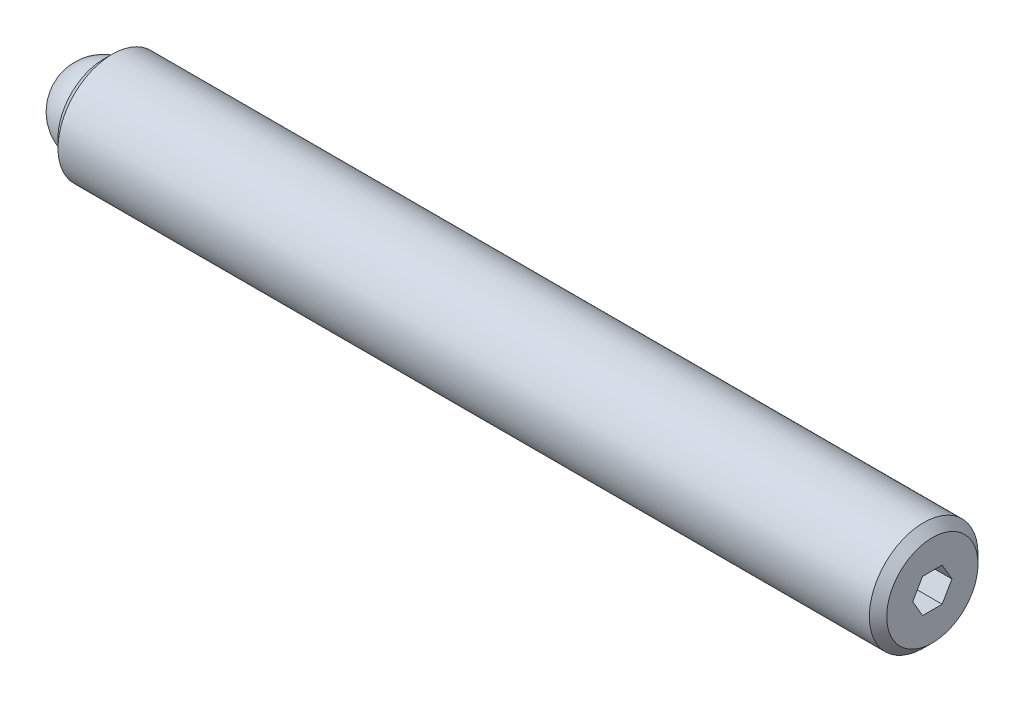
from build123d import *

# Parameters (mm, degrees)
SKETCH2_R           = 3.175
BOSS_EXTRUDE1_DEPTH = 48.41875
CHAMFER1_SIZE       = 0.508
CHAMFER2_SIZE       = 0.508
CUT_EXTRUDE2_DEPTH  = 2.286
SKETCH3_R           = 2.38125
CUT_EXTRUDE3_DEPTH  = 2.38125
CUT_EXTRUDE4_DEPTH  = 2.38125


with BuildPart() as part:
    # Sketch2 → Boss-Extrude1 (new body)
    with BuildSketch(Plane(origin=(0, 0, 0), x_dir=(0, 0, -1), z_dir=(1, 0, 0))):
        Circle(SKETCH2_R)
    extrude(amount=BOSS_EXTRUDE1_DEPTH)

    # Chamfer1
    chamfer1_edges = [part.edges().sort_by_distance(p)[0] for p in [
        (0, 0, 3.175),
    ]]
    chamfer(chamfer1_edges, length=CHAMFER1_SIZE)

    # Chamfer2
    chamfer2_edges = [part.edges().sort_by_distance(p)[0] for p in [
        (48.41875, 0, 3.175),
    ]]
    chamfer(chamfer2_edges, length=CHAMFER2_SIZE)

    # Sketch4 → Cut-Extrude2 (cut)
    with BuildSketch(Plane(origin=(48.41875, 0, 0), x_dir=(0, 0, -1), z_dir=(1, 0, 0))):
        Polygon((1.14567944, 0), (0.57283972, 0.9921875), (-0.57283972, 0.9921875), (-1.14567944, 0), (-0.57283972, -0.9921875), (0.57283972, -0.9921875), align=None)
    extrude(amount=-CUT_EXTRUDE2_DEPTH, mode=Mode.SUBTRACT)

    # Sketch3 → Cut-Extrude3 (cut)
    with BuildSketch(Plane.ZY):
        Circle(SKETCH3_R)
    extrude(amount=-CUT_EXTRUDE3_DEPTH, mode=Mode.SUBTRACT)

    # Sketch7 → Cut-Extrude4 (cut)
    with BuildSketch(Plane.ZY):
        with BuildLine():
            ThreePointArc((0.063494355, 2.380403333), (0, 2.38125), (-0.063494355, 2.380403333))
            ThreePointArc((-0.063494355, 2.380403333), (0, 2.44475), (0.063494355, 2.380403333))
        make_face()
    extrude(amount=-CUT_EXTRUDE4_DEPTH, mode=Mode.SUBTRACT)


with BuildPart() as body_2:
    # Sketch5 → Revolve1 (revolve)
    with BuildSketch(Plane.ZY):
        with BuildLine():
            Line((0, 0), (0, -2.38125))
            ThreePointArc((0, -2.38125), (-2.38125, 0), (0, 2.38125))
            Line((0, 2.38125), (0, 0))
        make_face()
    revolve(axis=Axis((0, 0, 0), (0, 1, 0)))


solid = Compound([part.part, body_2.part])
